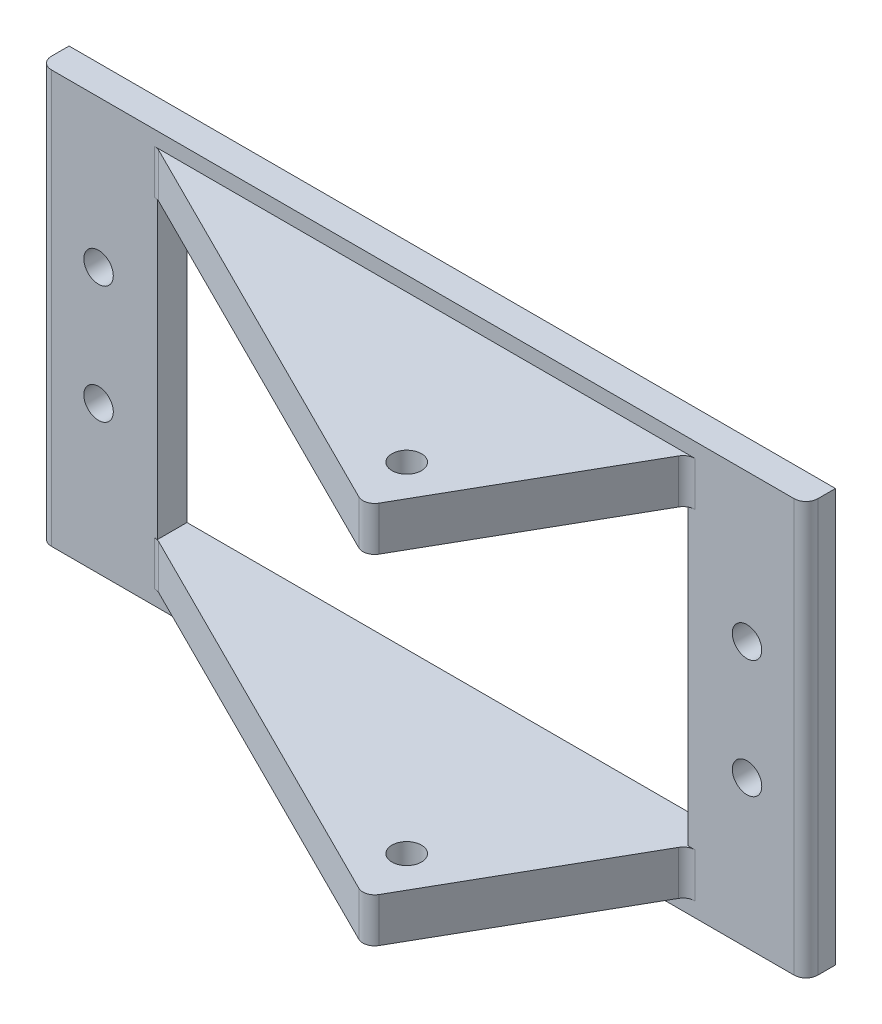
ISO-10303-21;
HEADER;
FILE_DESCRIPTION(('STEP AP214'),'2;1');
FILE_NAME('part.step','',(''),(''),'','','');
FILE_SCHEMA(('AUTOMOTIVE_DESIGN { 1 0 10303 214 1 1 1 1 }'));
ENDSEC;
DATA;
#1=APPLICATION_CONTEXT('core data for automotive mechanical design processes');
#2=APPLICATION_PROTOCOL_DEFINITION('international standard','automotive_design',2000,#1);
#3=PRODUCT_CONTEXT('',#1,'mechanical');
#4=PRODUCT('Part','Part','',(#3));
#5=PRODUCT_RELATED_PRODUCT_CATEGORY('part','',(#4));
#6=PRODUCT_DEFINITION_FORMATION('','',#4);
#7=PRODUCT_DEFINITION_CONTEXT('part definition',#1,'design');
#8=PRODUCT_DEFINITION('design','',#6,#7);
#9=PRODUCT_DEFINITION_SHAPE('','',#8);
#10=(LENGTH_UNIT() NAMED_UNIT(*) SI_UNIT(.MILLI.,.METRE.));
#11=(NAMED_UNIT(*) PLANE_ANGLE_UNIT() SI_UNIT($,.RADIAN.));
#12=(NAMED_UNIT(*) SI_UNIT($,.STERADIAN.) SOLID_ANGLE_UNIT());
#13=UNCERTAINTY_MEASURE_WITH_UNIT(LENGTH_MEASURE(1.E-05),#10,'distance_accuracy_value','');
#14=(GEOMETRIC_REPRESENTATION_CONTEXT(3) GLOBAL_UNCERTAINTY_ASSIGNED_CONTEXT((#13)) GLOBAL_UNIT_ASSIGNED_CONTEXT((#10,
#11,#12)) REPRESENTATION_CONTEXT('',''));
#15=CARTESIAN_POINT('',(0.,0.,0.));
#16=DIRECTION('',(0.,0.,1.));
#17=DIRECTION('',(1.,0.,0.));
#18=AXIS2_PLACEMENT_3D('',#15,#16,#17);
#19=CARTESIAN_POINT('',(-57.15,-31.75,0.));
#20=DIRECTION('',(0.,-1.,0.));
#21=DIRECTION('',(0.,0.,-1.));
#22=AXIS2_PLACEMENT_3D('',#19,#20,#21);
#23=PLANE('',#22);
#24=CARTESIAN_POINT('',(28.2863636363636,-31.75,38.1));
#25=DIRECTION('',(0.,-1.,0.));
#26=DIRECTION('',(0.,0.,-1.));
#27=AXIS2_PLACEMENT_3D('',#24,#25,#26);
#28=CIRCLE('',#27,3.175);
#29=CARTESIAN_POINT('',(28.2863636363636,-31.75,34.925));
#30=VERTEX_POINT('',#29);
#31=EDGE_CURVE('E372',#30,#30,#28,.T.);
#32=ORIENTED_EDGE('',*,*,#31,.T.);
#33=EDGE_LOOP('',(#32));
#34=FACE_BOUND('',#33,.T.);
#35=DIRECTION('',(-0.894427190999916,0.,-0.447213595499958));
#36=VECTOR('',#35,1.);
#37=CARTESIAN_POINT('',(-59.69,-31.75,5.08000000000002));
#38=LINE('',#37,#36);
#39=CARTESIAN_POINT('',(29.6008653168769,-31.75,49.7254326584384));
#40=VERTEX_POINT('',#39);
#41=CARTESIAN_POINT('',(-56.6136901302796,-31.75,6.61815493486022));
#42=VERTEX_POINT('',#41);
#43=EDGE_CURVE('E369',#40,#42,#38,.T.);
#44=ORIENTED_EDGE('',*,*,#43,.F.);
#45=CARTESIAN_POINT('',(30.7367878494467,-31.75,47.4535875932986));
#46=DIRECTION('',(0.,-1.,0.));
#47=DIRECTION('',(0.,0.,-1.));
#48=AXIS2_PLACEMENT_3D('',#45,#46,#47);
#49=CIRCLE('',#48,2.54);
#50=CARTESIAN_POINT('',(32.9421254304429,-31.75,48.713780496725));
#51=VERTEX_POINT('',#50);
#52=EDGE_CURVE('E322',#40,#51,#49,.F.);
#53=ORIENTED_EDGE('',*,*,#52,.T.);
#54=DIRECTION('',(-0.496138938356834,0.,0.868243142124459));
#55=VECTOR('',#54,1.);
#56=CARTESIAN_POINT('',(31.75,-31.75,50.8));
#57=LINE('',#56,#55);
#58=CARTESIAN_POINT('',(56.4186816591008,-31.75,7.62980709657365));
#59=VERTEX_POINT('',#58);
#60=EDGE_CURVE('E516',#59,#51,#57,.T.);
#61=ORIENTED_EDGE('',*,*,#60,.F.);
#62=CARTESIAN_POINT('',(58.6240192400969,-31.75,8.89));
#63=DIRECTION('',(0.,-1.,0.));
#64=DIRECTION('',(0.,0.,-1.));
#65=AXIS2_PLACEMENT_3D('',#62,#63,#64);
#66=CIRCLE('',#65,2.54);
#67=CARTESIAN_POINT('',(58.6240192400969,-31.75,6.35));
#68=VERTEX_POINT('',#67);
#69=EDGE_CURVE('E340',#59,#68,#66,.T.);
#70=ORIENTED_EDGE('',*,*,#69,.T.);
#71=DIRECTION('',(1.,0.,0.));
#72=VECTOR('',#71,1.);
#73=CARTESIAN_POINT('',(-57.15,-31.75,6.35));
#74=LINE('',#73,#72);
#75=CARTESIAN_POINT('',(57.15,-31.75,6.35));
#76=VERTEX_POINT('',#75);
#77=EDGE_CURVE('E87',#76,#68,#74,.T.);
#78=ORIENTED_EDGE('',*,*,#77,.F.);
#79=DIRECTION('',(0.,0.,1.));
#80=VECTOR('',#79,1.);
#81=CARTESIAN_POINT('',(57.15,-31.75,0.));
#82=LINE('',#81,#80);
#83=CARTESIAN_POINT('',(57.15,-31.75,0.));
#84=VERTEX_POINT('',#83);
#85=EDGE_CURVE('E228',#84,#76,#82,.T.);
#86=ORIENTED_EDGE('',*,*,#85,.F.);
#87=DIRECTION('',(1.,0.,0.));
#88=VECTOR('',#87,1.);
#89=CARTESIAN_POINT('',(-57.15,-31.75,0.));
#90=LINE('',#89,#88);
#91=CARTESIAN_POINT('',(-57.15,-31.75,0.));
#92=VERTEX_POINT('',#91);
#93=EDGE_CURVE('E238',#92,#84,#90,.T.);
#94=ORIENTED_EDGE('',*,*,#93,.F.);
#95=DIRECTION('',(0.,0.,1.));
#96=VECTOR('',#95,1.);
#97=CARTESIAN_POINT('',(-57.15,-31.75,0.));
#98=LINE('',#97,#96);
#99=CARTESIAN_POINT('',(-57.15,-31.75,6.35));
#100=VERTEX_POINT('',#99);
#101=EDGE_CURVE('E241',#92,#100,#98,.T.);
#102=ORIENTED_EDGE('',*,*,#101,.T.);
#103=DIRECTION('',(1.,0.,0.));
#104=VECTOR('',#103,1.);
#105=CARTESIAN_POINT('',(-57.15,-31.75,6.35));
#106=LINE('',#105,#104);
#107=CARTESIAN_POINT('',(-57.7496126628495,-31.75,6.35));
#108=VERTEX_POINT('',#107);
#109=EDGE_CURVE('E280',#108,#100,#106,.T.);
#110=ORIENTED_EDGE('',*,*,#109,.F.);
#111=CARTESIAN_POINT('',(-57.7496126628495,-31.75,8.89));
#112=DIRECTION('',(0.,-1.,0.));
#113=DIRECTION('',(0.,0.,-1.));
#114=AXIS2_PLACEMENT_3D('',#111,#112,#113);
#115=CIRCLE('',#114,2.54);
#116=EDGE_CURVE('E347',#108,#42,#115,.T.);
#117=ORIENTED_EDGE('',*,*,#116,.T.);
#118=EDGE_LOOP('',(#44,#53,#61,#70,#78,#86,#94,#102,#110,#117));
#119=FACE_BOUND('',#118,.T.);
#120=ADVANCED_FACE('F64',(#34,#119),#23,.F.);
#121=CARTESIAN_POINT('',(-57.15,31.75,0.));
#122=DIRECTION('',(0.,1.,0.));
#123=DIRECTION('',(0.,0.,1.));
#124=AXIS2_PLACEMENT_3D('',#121,#122,#123);
#125=PLANE('',#124);
#126=CARTESIAN_POINT('',(28.2863636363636,31.75,38.1));
#127=DIRECTION('',(0.,1.,0.));
#128=DIRECTION('',(0.,0.,1.));
#129=AXIS2_PLACEMENT_3D('',#126,#127,#128);
#130=CIRCLE('',#129,3.175);
#131=CARTESIAN_POINT('',(28.2863636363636,31.75,41.275));
#132=VERTEX_POINT('',#131);
#133=EDGE_CURVE('E526',#132,#132,#130,.T.);
#134=ORIENTED_EDGE('',*,*,#133,.T.);
#135=EDGE_LOOP('',(#134));
#136=FACE_BOUND('',#135,.T.);
#137=DIRECTION('',(0.496138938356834,0.,-0.868243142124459));
#138=VECTOR('',#137,1.);
#139=CARTESIAN_POINT('',(31.75,31.75,50.8));
#140=LINE('',#139,#138);
#141=CARTESIAN_POINT('',(32.9421254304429,31.75,48.713780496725));
#142=VERTEX_POINT('',#141);
#143=CARTESIAN_POINT('',(56.4186816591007,31.75,7.62980709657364));
#144=VERTEX_POINT('',#143);
#145=EDGE_CURVE('E523',#142,#144,#140,.T.);
#146=ORIENTED_EDGE('',*,*,#145,.F.);
#147=CARTESIAN_POINT('',(30.7367878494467,31.75,47.4535875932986));
#148=DIRECTION('',(0.,1.,0.));
#149=DIRECTION('',(0.,0.,1.));
#150=AXIS2_PLACEMENT_3D('',#147,#148,#149);
#151=CIRCLE('',#150,2.54);
#152=CARTESIAN_POINT('',(29.6008653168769,31.75,49.7254326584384));
#153=VERTEX_POINT('',#152);
#154=EDGE_CURVE('E324',#142,#153,#151,.F.);
#155=ORIENTED_EDGE('',*,*,#154,.T.);
#156=DIRECTION('',(0.894427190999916,0.,0.447213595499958));
#157=VECTOR('',#156,1.);
#158=CARTESIAN_POINT('',(-59.69,31.75,5.08000000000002));
#159=LINE('',#158,#157);
#160=CARTESIAN_POINT('',(-56.6136901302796,31.75,6.61815493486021));
#161=VERTEX_POINT('',#160);
#162=EDGE_CURVE('E350',#161,#153,#159,.T.);
#163=ORIENTED_EDGE('',*,*,#162,.F.);
#164=CARTESIAN_POINT('',(-57.7496126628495,31.75,8.89));
#165=DIRECTION('',(0.,1.,0.));
#166=DIRECTION('',(0.,0.,1.));
#167=AXIS2_PLACEMENT_3D('',#164,#165,#166);
#168=CIRCLE('',#167,2.54);
#169=CARTESIAN_POINT('',(-57.7496126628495,31.75,6.35));
#170=VERTEX_POINT('',#169);
#171=EDGE_CURVE('E72',#161,#170,#168,.T.);
#172=ORIENTED_EDGE('',*,*,#171,.T.);
#173=DIRECTION('',(-1.,0.,0.));
#174=VECTOR('',#173,1.);
#175=CARTESIAN_POINT('',(-57.15,31.75,6.35));
#176=LINE('',#175,#174);
#177=CARTESIAN_POINT('',(-57.15,31.75,6.35));
#178=VERTEX_POINT('',#177);
#179=EDGE_CURVE('E79',#178,#170,#176,.T.);
#180=ORIENTED_EDGE('',*,*,#179,.F.);
#181=DIRECTION('',(0.,0.,1.));
#182=VECTOR('',#181,1.);
#183=CARTESIAN_POINT('',(-57.15,31.75,0.));
#184=LINE('',#183,#182);
#185=CARTESIAN_POINT('',(-57.15,31.75,0.));
#186=VERTEX_POINT('',#185);
#187=EDGE_CURVE('E237',#186,#178,#184,.T.);
#188=ORIENTED_EDGE('',*,*,#187,.F.);
#189=DIRECTION('',(-1.,0.,0.));
#190=VECTOR('',#189,1.);
#191=CARTESIAN_POINT('',(-57.15,31.75,0.));
#192=LINE('',#191,#190);
#193=CARTESIAN_POINT('',(57.15,31.75,0.));
#194=VERTEX_POINT('',#193);
#195=EDGE_CURVE('E235',#194,#186,#192,.T.);
#196=ORIENTED_EDGE('',*,*,#195,.F.);
#197=DIRECTION('',(0.,0.,1.));
#198=VECTOR('',#197,1.);
#199=CARTESIAN_POINT('',(57.15,31.75,0.));
#200=LINE('',#199,#198);
#201=CARTESIAN_POINT('',(57.15,31.75,6.35));
#202=VERTEX_POINT('',#201);
#203=EDGE_CURVE('E226',#194,#202,#200,.T.);
#204=ORIENTED_EDGE('',*,*,#203,.T.);
#205=DIRECTION('',(-1.,0.,0.));
#206=VECTOR('',#205,1.);
#207=CARTESIAN_POINT('',(-57.15,31.75,6.35));
#208=LINE('',#207,#206);
#209=CARTESIAN_POINT('',(58.6240192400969,31.75,6.35));
#210=VERTEX_POINT('',#209);
#211=EDGE_CURVE('E212',#210,#202,#208,.T.);
#212=ORIENTED_EDGE('',*,*,#211,.F.);
#213=CARTESIAN_POINT('',(58.6240192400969,31.75,8.89));
#214=DIRECTION('',(0.,1.,0.));
#215=DIRECTION('',(0.,0.,1.));
#216=AXIS2_PLACEMENT_3D('',#213,#214,#215);
#217=CIRCLE('',#216,2.54);
#218=EDGE_CURVE('E338',#210,#144,#217,.T.);
#219=ORIENTED_EDGE('',*,*,#218,.T.);
#220=EDGE_LOOP('',(#146,#155,#163,#172,#180,#188,#196,#204,#212,#219));
#221=FACE_BOUND('',#220,.T.);
#222=ADVANCED_FACE('F233',(#136,#221),#125,.F.);
#223=CARTESIAN_POINT('',(57.15,41.275,6.35));
#224=DIRECTION('',(0.,1.,0.));
#225=DIRECTION('',(-1.,0.,0.));
#226=AXIS2_PLACEMENT_3D('',#223,#224,#225);
#227=PLANE('',#226);
#228=CARTESIAN_POINT('',(28.2863636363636,41.275,38.1));
#229=DIRECTION('',(0.,1.,0.));
#230=DIRECTION('',(-1.,0.,0.));
#231=AXIS2_PLACEMENT_3D('',#228,#229,#230);
#232=CIRCLE('',#231,3.175);
#233=CARTESIAN_POINT('',(25.1113636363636,41.275,38.1));
#234=VERTEX_POINT('',#233);
#235=EDGE_CURVE('E522',#234,#234,#232,.T.);
#236=ORIENTED_EDGE('',*,*,#235,.F.);
#237=EDGE_LOOP('',(#236));
#238=FACE_BOUND('',#237,.T.);
#239=DIRECTION('',(0.894427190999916,0.,0.447213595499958));
#240=VECTOR('',#239,1.);
#241=CARTESIAN_POINT('',(34.29,41.275,52.07));
#242=LINE('',#241,#240);
#243=CARTESIAN_POINT('',(-56.6136901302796,41.275,6.6181549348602));
#244=VERTEX_POINT('',#243);
#245=CARTESIAN_POINT('',(29.6008653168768,41.275,49.7254326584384));
#246=VERTEX_POINT('',#245);
#247=EDGE_CURVE('E362',#244,#246,#242,.T.);
#248=ORIENTED_EDGE('',*,*,#247,.T.);
#249=CARTESIAN_POINT('',(30.7367878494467,41.275,47.4535875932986));
#250=DIRECTION('',(0.,1.,0.));
#251=DIRECTION('',(-1.,0.,0.));
#252=AXIS2_PLACEMENT_3D('',#249,#250,#251);
#253=CIRCLE('',#252,2.54);
#254=CARTESIAN_POINT('',(32.9421254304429,41.275,48.713780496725));
#255=VERTEX_POINT('',#254);
#256=EDGE_CURVE('E331',#246,#255,#253,.T.);
#257=ORIENTED_EDGE('',*,*,#256,.T.);
#258=DIRECTION('',(0.496138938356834,0.,-0.868243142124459));
#259=VECTOR('',#258,1.);
#260=CARTESIAN_POINT('',(57.15,41.275,6.35));
#261=LINE('',#260,#259);
#262=CARTESIAN_POINT('',(56.4186816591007,41.275,7.62980709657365));
#263=VERTEX_POINT('',#262);
#264=EDGE_CURVE('E529',#255,#263,#261,.T.);
#265=ORIENTED_EDGE('',*,*,#264,.T.);
#266=CARTESIAN_POINT('',(58.6240192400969,41.275,8.89));
#267=DIRECTION('',(0.,1.,0.));
#268=DIRECTION('',(-1.,0.,0.));
#269=AXIS2_PLACEMENT_3D('',#266,#267,#268);
#270=CIRCLE('',#269,2.54);
#271=CARTESIAN_POINT('',(58.6240192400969,41.275,6.35));
#272=VERTEX_POINT('',#271);
#273=EDGE_CURVE('E335',#263,#272,#270,.F.);
#274=ORIENTED_EDGE('',*,*,#273,.T.);
#275=DIRECTION('',(-1.,0.,0.));
#276=VECTOR('',#275,1.);
#277=CARTESIAN_POINT('',(57.15,41.275,6.35));
#278=LINE('',#277,#276);
#279=CARTESIAN_POINT('',(-57.7496126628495,41.275,6.35));
#280=VERTEX_POINT('',#279);
#281=EDGE_CURVE('E229',#272,#280,#278,.T.);
#282=ORIENTED_EDGE('',*,*,#281,.T.);
#283=CARTESIAN_POINT('',(-57.7496126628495,41.275,8.89));
#284=DIRECTION('',(0.,1.,0.));
#285=DIRECTION('',(-1.,0.,0.));
#286=AXIS2_PLACEMENT_3D('',#283,#284,#285);
#287=CIRCLE('',#286,2.54);
#288=EDGE_CURVE('E12',#280,#244,#287,.F.);
#289=ORIENTED_EDGE('',*,*,#288,.T.);
#290=EDGE_LOOP('',(#248,#257,#265,#274,#282,#289));
#291=FACE_BOUND('',#290,.T.);
#292=ADVANCED_FACE('F361',(#238,#291),#227,.T.);
#293=CARTESIAN_POINT('',(57.15,-41.275,6.35));
#294=DIRECTION('',(0.,-1.,0.));
#295=DIRECTION('',(1.,0.,0.));
#296=AXIS2_PLACEMENT_3D('',#293,#294,#295);
#297=PLANE('',#296);
#298=CARTESIAN_POINT('',(28.2863636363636,-41.275,38.1));
#299=DIRECTION('',(0.,-1.,0.));
#300=DIRECTION('',(1.,0.,0.));
#301=AXIS2_PLACEMENT_3D('',#298,#299,#300);
#302=CIRCLE('',#301,3.175);
#303=CARTESIAN_POINT('',(31.4613636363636,-41.275,38.1));
#304=VERTEX_POINT('',#303);
#305=EDGE_CURVE('E767',#304,#304,#302,.T.);
#306=ORIENTED_EDGE('',*,*,#305,.F.);
#307=EDGE_LOOP('',(#306));
#308=FACE_BOUND('',#307,.T.);
#309=DIRECTION('',(-0.496138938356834,0.,0.868243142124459));
#310=VECTOR('',#309,1.);
#311=CARTESIAN_POINT('',(45.8176923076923,-41.275,26.1815384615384));
#312=LINE('',#311,#310);
#313=CARTESIAN_POINT('',(56.4186816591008,-41.275,7.62980709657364));
#314=VERTEX_POINT('',#313);
#315=CARTESIAN_POINT('',(32.9421254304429,-41.275,48.713780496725));
#316=VERTEX_POINT('',#315);
#317=EDGE_CURVE('E766',#314,#316,#312,.T.);
#318=ORIENTED_EDGE('',*,*,#317,.T.);
#319=CARTESIAN_POINT('',(30.7367878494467,-41.275,47.4535875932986));
#320=DIRECTION('',(0.,-1.,0.));
#321=DIRECTION('',(1.,0.,0.));
#322=AXIS2_PLACEMENT_3D('',#319,#320,#321);
#323=CIRCLE('',#322,2.54);
#324=CARTESIAN_POINT('',(29.6008653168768,-41.275,49.7254326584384));
#325=VERTEX_POINT('',#324);
#326=EDGE_CURVE('E315',#316,#325,#323,.T.);
#327=ORIENTED_EDGE('',*,*,#326,.T.);
#328=DIRECTION('',(-0.894427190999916,0.,-0.447213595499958));
#329=VECTOR('',#328,1.);
#330=CARTESIAN_POINT('',(-13.97,-41.275,27.94));
#331=LINE('',#330,#329);
#332=CARTESIAN_POINT('',(-56.6136901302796,-41.275,6.61815493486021));
#333=VERTEX_POINT('',#332);
#334=EDGE_CURVE('E367',#325,#333,#331,.T.);
#335=ORIENTED_EDGE('',*,*,#334,.T.);
#336=CARTESIAN_POINT('',(-57.7496126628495,-41.275,8.89));
#337=DIRECTION('',(0.,-1.,0.));
#338=DIRECTION('',(1.,0.,0.));
#339=AXIS2_PLACEMENT_3D('',#336,#337,#338);
#340=CIRCLE('',#339,2.54);
#341=CARTESIAN_POINT('',(-57.7496126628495,-41.275,6.35));
#342=VERTEX_POINT('',#341);
#343=EDGE_CURVE('E344',#333,#342,#340,.F.);
#344=ORIENTED_EDGE('',*,*,#343,.T.);
#345=DIRECTION('',(1.,0.,0.));
#346=VECTOR('',#345,1.);
#347=CARTESIAN_POINT('',(57.15,-41.275,6.35));
#348=LINE('',#347,#346);
#349=CARTESIAN_POINT('',(58.6240192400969,-41.275,6.35));
#350=VERTEX_POINT('',#349);
#351=EDGE_CURVE('E230',#342,#350,#348,.T.);
#352=ORIENTED_EDGE('',*,*,#351,.T.);
#353=CARTESIAN_POINT('',(58.6240192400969,-41.275,8.89));
#354=DIRECTION('',(0.,-1.,0.));
#355=DIRECTION('',(1.,0.,0.));
#356=AXIS2_PLACEMENT_3D('',#353,#354,#355);
#357=CIRCLE('',#356,2.54);
#358=EDGE_CURVE('E342',#350,#314,#357,.F.);
#359=ORIENTED_EDGE('',*,*,#358,.T.);
#360=EDGE_LOOP('',(#318,#327,#335,#344,#352,#359));
#361=FACE_BOUND('',#360,.T.);
#362=ADVANCED_FACE('F481',(#308,#361),#297,.T.);
#363=CARTESIAN_POINT('',(82.5499999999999,44.45,50.8));
#364=DIRECTION('',(-1.,0.,0.));
#365=DIRECTION('',(0.,-1.,0.));
#366=AXIS2_PLACEMENT_3D('',#363,#364,#365);
#367=PLANE('',#366);
#368=DIRECTION('',(0.,0.,-1.));
#369=VECTOR('',#368,1.);
#370=CARTESIAN_POINT('',(82.5499999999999,44.45,50.8));
#371=LINE('',#370,#369);
#372=CARTESIAN_POINT('',(82.5499999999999,44.45,3.81));
#373=VERTEX_POINT('',#372);
#374=CARTESIAN_POINT('',(82.5499999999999,44.45,0.));
#375=VERTEX_POINT('',#374);
#376=EDGE_CURVE('E266',#373,#375,#371,.T.);
#377=ORIENTED_EDGE('',*,*,#376,.F.);
#378=DIRECTION('',(0.,1.,0.));
#379=VECTOR('',#378,1.);
#380=CARTESIAN_POINT('',(82.5499999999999,44.45,3.81));
#381=LINE('',#380,#379);
#382=CARTESIAN_POINT('',(82.55,-44.45,3.81));
#383=VERTEX_POINT('',#382);
#384=EDGE_CURVE('E297',#373,#383,#381,.F.);
#385=ORIENTED_EDGE('',*,*,#384,.T.);
#386=DIRECTION('',(0.,0.,-1.));
#387=VECTOR('',#386,1.);
#388=CARTESIAN_POINT('',(82.55,-44.45,50.8));
#389=LINE('',#388,#387);
#390=CARTESIAN_POINT('',(82.55,-44.45,0.));
#391=VERTEX_POINT('',#390);
#392=EDGE_CURVE('E260',#383,#391,#389,.T.);
#393=ORIENTED_EDGE('',*,*,#392,.T.);
#394=DIRECTION('',(0.,1.,0.));
#395=VECTOR('',#394,1.);
#396=CARTESIAN_POINT('',(82.5499999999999,44.45,0.));
#397=LINE('',#396,#395);
#398=EDGE_CURVE('E248',#391,#375,#397,.T.);
#399=ORIENTED_EDGE('',*,*,#398,.T.);
#400=EDGE_LOOP('',(#377,#385,#393,#399));
#401=FACE_BOUND('',#400,.T.);
#402=ADVANCED_FACE('F429',(#401),#367,.F.);
#403=CARTESIAN_POINT('',(-82.5500000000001,44.45,50.8));
#404=DIRECTION('',(0.,-1.,0.));
#405=DIRECTION('',(0.,0.,-1.));
#406=AXIS2_PLACEMENT_3D('',#403,#404,#405);
#407=PLANE('',#406);
#408=DIRECTION('',(-1.,0.,0.));
#409=VECTOR('',#408,1.);
#410=CARTESIAN_POINT('',(82.55,44.45,6.35));
#411=LINE('',#410,#409);
#412=CARTESIAN_POINT('',(80.0099999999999,44.45,6.35));
#413=VERTEX_POINT('',#412);
#414=CARTESIAN_POINT('',(-80.01,44.45,6.35));
#415=VERTEX_POINT('',#414);
#416=EDGE_CURVE('E273',#413,#415,#411,.T.);
#417=ORIENTED_EDGE('',*,*,#416,.F.);
#418=CARTESIAN_POINT('',(80.0099999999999,44.45,3.81));
#419=DIRECTION('',(0.,-1.,0.));
#420=DIRECTION('',(0.,0.,-1.));
#421=AXIS2_PLACEMENT_3D('',#418,#419,#420);
#422=CIRCLE('',#421,2.54);
#423=EDGE_CURVE('E295',#413,#373,#422,.F.);
#424=ORIENTED_EDGE('',*,*,#423,.T.);
#425=ORIENTED_EDGE('',*,*,#376,.T.);
#426=DIRECTION('',(-1.,0.,0.));
#427=VECTOR('',#426,1.);
#428=CARTESIAN_POINT('',(-82.5500000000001,44.45,0.));
#429=LINE('',#428,#427);
#430=CARTESIAN_POINT('',(-82.5500000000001,44.45,0.));
#431=VERTEX_POINT('',#430);
#432=EDGE_CURVE('E251',#375,#431,#429,.T.);
#433=ORIENTED_EDGE('',*,*,#432,.T.);
#434=DIRECTION('',(0.,0.,-1.));
#435=VECTOR('',#434,1.);
#436=CARTESIAN_POINT('',(-82.5500000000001,44.45,50.8));
#437=LINE('',#436,#435);
#438=CARTESIAN_POINT('',(-82.5500000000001,44.45,3.81));
#439=VERTEX_POINT('',#438);
#440=EDGE_CURVE('E264',#439,#431,#437,.T.);
#441=ORIENTED_EDGE('',*,*,#440,.F.);
#442=CARTESIAN_POINT('',(-80.0100000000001,44.45,3.81));
#443=DIRECTION('',(0.,-1.,0.));
#444=DIRECTION('',(0.,0.,-1.));
#445=AXIS2_PLACEMENT_3D('',#442,#443,#444);
#446=CIRCLE('',#445,2.54);
#447=EDGE_CURVE('E293',#439,#415,#446,.F.);
#448=ORIENTED_EDGE('',*,*,#447,.T.);
#449=EDGE_LOOP('',(#417,#424,#425,#433,#441,#448));
#450=FACE_BOUND('',#449,.T.);
#451=ADVANCED_FACE('F443',(#450),#407,.F.);
#452=CARTESIAN_POINT('',(-82.5500000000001,44.45,50.8));
#453=DIRECTION('',(1.,0.,0.));
#454=DIRECTION('',(0.,1.,0.));
#455=AXIS2_PLACEMENT_3D('',#452,#453,#454);
#456=PLANE('',#455);
#457=DIRECTION('',(0.,0.,-1.));
#458=VECTOR('',#457,1.);
#459=CARTESIAN_POINT('',(-82.55,-44.45,50.8));
#460=LINE('',#459,#458);
#461=CARTESIAN_POINT('',(-82.55,-44.45,3.81));
#462=VERTEX_POINT('',#461);
#463=CARTESIAN_POINT('',(-82.55,-44.45,0.));
#464=VERTEX_POINT('',#463);
#465=EDGE_CURVE('E262',#462,#464,#460,.T.);
#466=ORIENTED_EDGE('',*,*,#465,.F.);
#467=DIRECTION('',(0.,-1.,0.));
#468=VECTOR('',#467,1.);
#469=CARTESIAN_POINT('',(-82.5500000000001,44.45,3.81));
#470=LINE('',#469,#468);
#471=EDGE_CURVE('E333',#462,#439,#470,.F.);
#472=ORIENTED_EDGE('',*,*,#471,.T.);
#473=ORIENTED_EDGE('',*,*,#440,.T.);
#474=DIRECTION('',(0.,-1.,0.));
#475=VECTOR('',#474,1.);
#476=CARTESIAN_POINT('',(-82.5500000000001,44.45,0.));
#477=LINE('',#476,#475);
#478=EDGE_CURVE('E254',#431,#464,#477,.T.);
#479=ORIENTED_EDGE('',*,*,#478,.T.);
#480=EDGE_LOOP('',(#466,#472,#473,#479));
#481=FACE_BOUND('',#480,.T.);
#482=ADVANCED_FACE('F438',(#481),#456,.F.);
#483=CARTESIAN_POINT('',(-82.55,-44.45,50.8));
#484=DIRECTION('',(0.,1.,0.));
#485=DIRECTION('',(0.,0.,1.));
#486=AXIS2_PLACEMENT_3D('',#483,#484,#485);
#487=PLANE('',#486);
#488=ORIENTED_EDGE('',*,*,#392,.F.);
#489=CARTESIAN_POINT('',(80.01,-44.45,3.81));
#490=DIRECTION('',(0.,1.,0.));
#491=DIRECTION('',(0.,0.,1.));
#492=AXIS2_PLACEMENT_3D('',#489,#490,#491);
#493=CIRCLE('',#492,2.54);
#494=CARTESIAN_POINT('',(80.01,-44.45,6.35));
#495=VERTEX_POINT('',#494);
#496=EDGE_CURVE('E301',#383,#495,#493,.F.);
#497=ORIENTED_EDGE('',*,*,#496,.T.);
#498=DIRECTION('',(1.,0.,0.));
#499=VECTOR('',#498,1.);
#500=CARTESIAN_POINT('',(82.55,-44.45,6.35));
#501=LINE('',#500,#499);
#502=CARTESIAN_POINT('',(-80.01,-44.45,6.35));
#503=VERTEX_POINT('',#502);
#504=EDGE_CURVE('E381',#503,#495,#501,.T.);
#505=ORIENTED_EDGE('',*,*,#504,.F.);
#506=CARTESIAN_POINT('',(-80.01,-44.45,3.81));
#507=DIRECTION('',(0.,1.,0.));
#508=DIRECTION('',(0.,0.,1.));
#509=AXIS2_PLACEMENT_3D('',#506,#507,#508);
#510=CIRCLE('',#509,2.54);
#511=EDGE_CURVE('E299',#503,#462,#510,.F.);
#512=ORIENTED_EDGE('',*,*,#511,.T.);
#513=ORIENTED_EDGE('',*,*,#465,.T.);
#514=DIRECTION('',(1.,0.,0.));
#515=VECTOR('',#514,1.);
#516=CARTESIAN_POINT('',(-82.55,-44.45,0.));
#517=LINE('',#516,#515);
#518=EDGE_CURVE('E257',#464,#391,#517,.T.);
#519=ORIENTED_EDGE('',*,*,#518,.T.);
#520=EDGE_LOOP('',(#488,#497,#505,#512,#513,#519));
#521=FACE_BOUND('',#520,.T.);
#522=ADVANCED_FACE('F420',(#521),#487,.F.);
#523=CARTESIAN_POINT('',(0.,0.,0.));
#524=DIRECTION('',(0.,0.,1.));
#525=DIRECTION('',(1.,0.,0.));
#526=AXIS2_PLACEMENT_3D('',#523,#524,#525);
#527=PLANE('',#526);
#528=CARTESIAN_POINT('',(69.85,12.7,0.));
#529=DIRECTION('',(0.,0.,1.));
#530=DIRECTION('',(-1.,0.,0.));
#531=AXIS2_PLACEMENT_3D('',#528,#529,#530);
#532=CIRCLE('',#531,3.175);
#533=CARTESIAN_POINT('',(66.675,12.7,0.));
#534=VERTEX_POINT('',#533);
#535=EDGE_CURVE('E394',#534,#534,#532,.T.);
#536=ORIENTED_EDGE('',*,*,#535,.T.);
#537=EDGE_LOOP('',(#536));
#538=FACE_BOUND('',#537,.T.);
#539=CARTESIAN_POINT('',(69.85,-12.7,0.));
#540=DIRECTION('',(0.,0.,1.));
#541=DIRECTION('',(1.,0.,0.));
#542=AXIS2_PLACEMENT_3D('',#539,#540,#541);
#543=CIRCLE('',#542,3.17499999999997);
#544=CARTESIAN_POINT('',(73.025,-12.7,0.));
#545=VERTEX_POINT('',#544);
#546=EDGE_CURVE('E402',#545,#545,#543,.T.);
#547=ORIENTED_EDGE('',*,*,#546,.T.);
#548=EDGE_LOOP('',(#547));
#549=FACE_BOUND('',#548,.T.);
#550=CARTESIAN_POINT('',(-69.85,-12.7,0.));
#551=DIRECTION('',(0.,0.,1.));
#552=DIRECTION('',(-1.,0.,0.));
#553=AXIS2_PLACEMENT_3D('',#550,#551,#552);
#554=CIRCLE('',#553,3.175);
#555=CARTESIAN_POINT('',(-73.025,-12.7,0.));
#556=VERTEX_POINT('',#555);
#557=EDGE_CURVE('E399',#556,#556,#554,.T.);
#558=ORIENTED_EDGE('',*,*,#557,.T.);
#559=EDGE_LOOP('',(#558));
#560=FACE_BOUND('',#559,.T.);
#561=CARTESIAN_POINT('',(-69.85,12.7,0.));
#562=DIRECTION('',(0.,0.,1.));
#563=DIRECTION('',(1.,0.,0.));
#564=AXIS2_PLACEMENT_3D('',#561,#562,#563);
#565=CIRCLE('',#564,3.175);
#566=CARTESIAN_POINT('',(-66.675,12.7,0.));
#567=VERTEX_POINT('',#566);
#568=EDGE_CURVE('E395',#567,#567,#565,.T.);
#569=ORIENTED_EDGE('',*,*,#568,.T.);
#570=EDGE_LOOP('',(#569));
#571=FACE_BOUND('',#570,.T.);
#572=ORIENTED_EDGE('',*,*,#93,.T.);
#573=DIRECTION('',(0.,1.,0.));
#574=VECTOR('',#573,1.);
#575=CARTESIAN_POINT('',(57.15,31.75,0.));
#576=LINE('',#575,#574);
#577=EDGE_CURVE('E398',#84,#194,#576,.T.);
#578=ORIENTED_EDGE('',*,*,#577,.T.);
#579=ORIENTED_EDGE('',*,*,#195,.T.);
#580=DIRECTION('',(0.,-1.,0.));
#581=VECTOR('',#580,1.);
#582=CARTESIAN_POINT('',(-57.15,31.75,0.));
#583=LINE('',#582,#581);
#584=EDGE_CURVE('E244',#186,#92,#583,.T.);
#585=ORIENTED_EDGE('',*,*,#584,.T.);
#586=EDGE_LOOP('',(#572,#578,#579,#585));
#587=FACE_BOUND('',#586,.T.);
#588=ORIENTED_EDGE('',*,*,#398,.F.);
#589=ORIENTED_EDGE('',*,*,#518,.F.);
#590=ORIENTED_EDGE('',*,*,#478,.F.);
#591=ORIENTED_EDGE('',*,*,#432,.F.);
#592=EDGE_LOOP('',(#588,#589,#590,#591));
#593=FACE_BOUND('',#592,.T.);
#594=ADVANCED_FACE('F417',(#538,#549,#560,#571,#587,#593),#527,.F.);
#595=CARTESIAN_POINT('',(57.15,31.75,0.));
#596=DIRECTION('',(1.,0.,0.));
#597=DIRECTION('',(0.,1.,0.));
#598=AXIS2_PLACEMENT_3D('',#595,#596,#597);
#599=PLANE('',#598);
#600=ORIENTED_EDGE('',*,*,#85,.T.);
#601=DIRECTION('',(0.,1.,0.));
#602=VECTOR('',#601,1.);
#603=CARTESIAN_POINT('',(57.15,41.275,6.35));
#604=LINE('',#603,#602);
#605=EDGE_CURVE('E216',#76,#202,#604,.T.);
#606=ORIENTED_EDGE('',*,*,#605,.T.);
#607=ORIENTED_EDGE('',*,*,#203,.F.);
#608=ORIENTED_EDGE('',*,*,#577,.F.);
#609=EDGE_LOOP('',(#600,#606,#607,#608));
#610=FACE_BOUND('',#609,.T.);
#611=ADVANCED_FACE('F224',(#610),#599,.F.);
#612=CARTESIAN_POINT('',(-57.15,31.75,0.));
#613=DIRECTION('',(-1.,0.,0.));
#614=DIRECTION('',(0.,0.,1.));
#615=AXIS2_PLACEMENT_3D('',#612,#613,#614);
#616=PLANE('',#615);
#617=ORIENTED_EDGE('',*,*,#187,.T.);
#618=DIRECTION('',(0.,-1.,0.));
#619=VECTOR('',#618,1.);
#620=CARTESIAN_POINT('',(-57.15,41.275,6.35));
#621=LINE('',#620,#619);
#622=EDGE_CURVE('E356',#178,#100,#621,.T.);
#623=ORIENTED_EDGE('',*,*,#622,.T.);
#624=ORIENTED_EDGE('',*,*,#101,.F.);
#625=ORIENTED_EDGE('',*,*,#584,.F.);
#626=EDGE_LOOP('',(#617,#623,#624,#625));
#627=FACE_BOUND('',#626,.T.);
#628=ADVANCED_FACE('F415',(#627),#616,.F.);
#629=CARTESIAN_POINT('',(-69.85,12.7,0.));
#630=DIRECTION('',(0.,0.,1.));
#631=DIRECTION('',(1.,0.,0.));
#632=AXIS2_PLACEMENT_3D('',#629,#630,#631);
#633=CYLINDRICAL_SURFACE('',#632,3.175);
#634=CARTESIAN_POINT('',(-69.85,12.7,6.35));
#635=DIRECTION('',(0.,0.,-1.));
#636=DIRECTION('',(-1.,0.,0.));
#637=AXIS2_PLACEMENT_3D('',#634,#635,#636);
#638=CIRCLE('',#637,3.175);
#639=CARTESIAN_POINT('',(-73.025,12.7,6.35));
#640=VERTEX_POINT('',#639);
#641=EDGE_CURVE('E391',#640,#640,#638,.F.);
#642=ORIENTED_EDGE('',*,*,#641,.T.);
#643=EDGE_LOOP('',(#642));
#644=FACE_BOUND('',#643,.T.);
#645=ORIENTED_EDGE('',*,*,#568,.F.);
#646=EDGE_LOOP('',(#645));
#647=FACE_BOUND('',#646,.T.);
#648=ADVANCED_FACE('F469',(#644,#647),#633,.F.);
#649=CARTESIAN_POINT('',(-69.85,-12.7,0.));
#650=DIRECTION('',(0.,0.,1.));
#651=DIRECTION('',(1.,0.,0.));
#652=AXIS2_PLACEMENT_3D('',#649,#650,#651);
#653=CYLINDRICAL_SURFACE('',#652,3.175);
#654=CARTESIAN_POINT('',(-69.85,-12.7,6.35));
#655=DIRECTION('',(0.,0.,-1.));
#656=DIRECTION('',(-1.,0.,0.));
#657=AXIS2_PLACEMENT_3D('',#654,#655,#656);
#658=CIRCLE('',#657,3.175);
#659=CARTESIAN_POINT('',(-73.025,-12.7,6.35));
#660=VERTEX_POINT('',#659);
#661=EDGE_CURVE('E388',#660,#660,#658,.F.);
#662=ORIENTED_EDGE('',*,*,#661,.T.);
#663=EDGE_LOOP('',(#662));
#664=FACE_BOUND('',#663,.T.);
#665=ORIENTED_EDGE('',*,*,#557,.F.);
#666=EDGE_LOOP('',(#665));
#667=FACE_BOUND('',#666,.T.);
#668=ADVANCED_FACE('F561',(#664,#667),#653,.F.);
#669=CARTESIAN_POINT('',(69.85,-12.7,0.));
#670=DIRECTION('',(0.,0.,1.));
#671=DIRECTION('',(1.,0.,0.));
#672=AXIS2_PLACEMENT_3D('',#669,#670,#671);
#673=CYLINDRICAL_SURFACE('',#672,3.17499999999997);
#674=CARTESIAN_POINT('',(69.85,-12.7,6.35));
#675=DIRECTION('',(0.,0.,-1.));
#676=DIRECTION('',(-1.,0.,0.));
#677=AXIS2_PLACEMENT_3D('',#674,#675,#676);
#678=CIRCLE('',#677,3.17499999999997);
#679=CARTESIAN_POINT('',(66.6750000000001,-12.7,6.35));
#680=VERTEX_POINT('',#679);
#681=EDGE_CURVE('E272',#680,#680,#678,.F.);
#682=ORIENTED_EDGE('',*,*,#681,.T.);
#683=EDGE_LOOP('',(#682));
#684=FACE_BOUND('',#683,.T.);
#685=ORIENTED_EDGE('',*,*,#546,.F.);
#686=EDGE_LOOP('',(#685));
#687=FACE_BOUND('',#686,.T.);
#688=ADVANCED_FACE('F564',(#684,#687),#673,.F.);
#689=CARTESIAN_POINT('',(69.85,12.7,0.));
#690=DIRECTION('',(0.,0.,1.));
#691=DIRECTION('',(1.,0.,0.));
#692=AXIS2_PLACEMENT_3D('',#689,#690,#691);
#693=CYLINDRICAL_SURFACE('',#692,3.175);
#694=CARTESIAN_POINT('',(69.85,12.7,6.35));
#695=DIRECTION('',(0.,0.,-1.));
#696=DIRECTION('',(-1.,0.,0.));
#697=AXIS2_PLACEMENT_3D('',#694,#695,#696);
#698=CIRCLE('',#697,3.175);
#699=CARTESIAN_POINT('',(66.675,12.7,6.35));
#700=VERTEX_POINT('',#699);
#701=EDGE_CURVE('E269',#700,#700,#698,.F.);
#702=ORIENTED_EDGE('',*,*,#701,.T.);
#703=EDGE_LOOP('',(#702));
#704=FACE_BOUND('',#703,.T.);
#705=ORIENTED_EDGE('',*,*,#535,.F.);
#706=EDGE_LOOP('',(#705));
#707=FACE_BOUND('',#706,.T.);
#708=ADVANCED_FACE('F466',(#704,#707),#693,.F.);
#709=CARTESIAN_POINT('',(0.,0.,6.35));
#710=DIRECTION('',(0.,0.,-1.));
#711=DIRECTION('',(-1.,0.,0.));
#712=AXIS2_PLACEMENT_3D('',#709,#710,#711);
#713=PLANE('',#712);
#714=ORIENTED_EDGE('',*,*,#281,.F.);
#715=DIRECTION('',(0.,1.,0.));
#716=VECTOR('',#715,1.);
#717=CARTESIAN_POINT('',(58.6240192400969,0.,6.35));
#718=LINE('',#717,#716);
#719=EDGE_CURVE('E219',#272,#210,#718,.F.);
#720=ORIENTED_EDGE('',*,*,#719,.T.);
#721=ORIENTED_EDGE('',*,*,#211,.T.);
#722=ORIENTED_EDGE('',*,*,#605,.F.);
#723=ORIENTED_EDGE('',*,*,#77,.T.);
#724=DIRECTION('',(0.,1.,0.));
#725=VECTOR('',#724,1.);
#726=CARTESIAN_POINT('',(58.6240192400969,0.,6.35));
#727=LINE('',#726,#725);
#728=EDGE_CURVE('E285',#68,#350,#727,.F.);
#729=ORIENTED_EDGE('',*,*,#728,.T.);
#730=ORIENTED_EDGE('',*,*,#351,.F.);
#731=DIRECTION('',(0.,-1.,0.));
#732=VECTOR('',#731,1.);
#733=CARTESIAN_POINT('',(-57.7496126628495,0.,6.35));
#734=LINE('',#733,#732);
#735=EDGE_CURVE('E282',#342,#108,#734,.F.);
#736=ORIENTED_EDGE('',*,*,#735,.T.);
#737=ORIENTED_EDGE('',*,*,#109,.T.);
#738=ORIENTED_EDGE('',*,*,#622,.F.);
#739=ORIENTED_EDGE('',*,*,#179,.T.);
#740=DIRECTION('',(0.,-1.,0.));
#741=VECTOR('',#740,1.);
#742=CARTESIAN_POINT('',(-57.7496126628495,0.,6.35));
#743=LINE('',#742,#741);
#744=EDGE_CURVE('E276',#170,#280,#743,.F.);
#745=ORIENTED_EDGE('',*,*,#744,.T.);
#746=EDGE_LOOP('',(#714,#720,#721,#722,#723,#729,#730,#736,#737,#738,#739,#745));
#747=FACE_BOUND('',#746,.T.);
#748=ORIENTED_EDGE('',*,*,#504,.T.);
#749=DIRECTION('',(0.,1.,0.));
#750=VECTOR('',#749,1.);
#751=CARTESIAN_POINT('',(80.01,0.,6.35));
#752=LINE('',#751,#750);
#753=EDGE_CURVE('E290',#495,#413,#752,.T.);
#754=ORIENTED_EDGE('',*,*,#753,.T.);
#755=ORIENTED_EDGE('',*,*,#416,.T.);
#756=DIRECTION('',(0.,-1.,0.));
#757=VECTOR('',#756,1.);
#758=CARTESIAN_POINT('',(-80.01,0.,6.35));
#759=LINE('',#758,#757);
#760=EDGE_CURVE('E268',#415,#503,#759,.T.);
#761=ORIENTED_EDGE('',*,*,#760,.T.);
#762=EDGE_LOOP('',(#748,#754,#755,#761));
#763=FACE_BOUND('',#762,.T.);
#764=ORIENTED_EDGE('',*,*,#661,.F.);
#765=EDGE_LOOP('',(#764));
#766=FACE_BOUND('',#765,.T.);
#767=ORIENTED_EDGE('',*,*,#701,.F.);
#768=EDGE_LOOP('',(#767));
#769=FACE_BOUND('',#768,.T.);
#770=ORIENTED_EDGE('',*,*,#681,.F.);
#771=EDGE_LOOP('',(#770));
#772=FACE_BOUND('',#771,.T.);
#773=ORIENTED_EDGE('',*,*,#641,.F.);
#774=EDGE_LOOP('',(#773));
#775=FACE_BOUND('',#774,.T.);
#776=ADVANCED_FACE('F214',(#747,#763,#766,#769,#772,#775),#713,.F.);
#777=CARTESIAN_POINT('',(-13.97,44.45,27.94));
#778=DIRECTION('',(-0.447213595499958,0.,0.894427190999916));
#779=DIRECTION('',(0.894427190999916,0.,0.447213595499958));
#780=AXIS2_PLACEMENT_3D('',#777,#778,#779);
#781=PLANE('',#780);
#782=ORIENTED_EDGE('',*,*,#334,.F.);
#783=DIRECTION('',(0.,-1.,0.));
#784=VECTOR('',#783,1.);
#785=CARTESIAN_POINT('',(29.6008653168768,44.45,49.7254326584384));
#786=LINE('',#785,#784);
#787=EDGE_CURVE('E320',#325,#40,#786,.F.);
#788=ORIENTED_EDGE('',*,*,#787,.T.);
#789=ORIENTED_EDGE('',*,*,#43,.T.);
#790=DIRECTION('',(0.,-1.,0.));
#791=VECTOR('',#790,1.);
#792=CARTESIAN_POINT('',(-56.6136901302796,44.45,6.61815493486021));
#793=LINE('',#792,#791);
#794=EDGE_CURVE('E317',#42,#333,#793,.T.);
#795=ORIENTED_EDGE('',*,*,#794,.T.);
#796=EDGE_LOOP('',(#782,#788,#789,#795));
#797=FACE_BOUND('',#796,.T.);
#798=ADVANCED_FACE('F511',(#797),#781,.T.);
#799=ORIENTED_EDGE('',*,*,#162,.T.);
#800=DIRECTION('',(0.,-1.,0.));
#801=VECTOR('',#800,1.);
#802=CARTESIAN_POINT('',(29.6008653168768,44.45,49.7254326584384));
#803=LINE('',#802,#801);
#804=EDGE_CURVE('E329',#153,#246,#803,.F.);
#805=ORIENTED_EDGE('',*,*,#804,.T.);
#806=ORIENTED_EDGE('',*,*,#247,.F.);
#807=DIRECTION('',(0.,-1.,0.));
#808=VECTOR('',#807,1.);
#809=CARTESIAN_POINT('',(-56.6136901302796,44.45,6.61815493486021));
#810=LINE('',#809,#808);
#811=EDGE_CURVE('E326',#244,#161,#810,.T.);
#812=ORIENTED_EDGE('',*,*,#811,.T.);
#813=EDGE_LOOP('',(#799,#805,#806,#812));
#814=FACE_BOUND('',#813,.T.);
#815=ADVANCED_FACE('F365',(#814),#781,.T.);
#816=CARTESIAN_POINT('',(45.8176923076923,44.45,26.1815384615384));
#817=DIRECTION('',(0.868243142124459,0.,0.496138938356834));
#818=DIRECTION('',(0.496138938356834,0.,-0.868243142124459));
#819=AXIS2_PLACEMENT_3D('',#816,#817,#818);
#820=PLANE('',#819);
#821=ORIENTED_EDGE('',*,*,#145,.T.);
#822=DIRECTION('',(0.,1.,0.));
#823=VECTOR('',#822,1.);
#824=CARTESIAN_POINT('',(56.4186816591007,44.45,7.62980709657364));
#825=LINE('',#824,#823);
#826=EDGE_CURVE('E306',#144,#263,#825,.T.);
#827=ORIENTED_EDGE('',*,*,#826,.T.);
#828=ORIENTED_EDGE('',*,*,#264,.F.);
#829=DIRECTION('',(0.,-1.,0.));
#830=VECTOR('',#829,1.);
#831=CARTESIAN_POINT('',(32.9421254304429,44.45,48.713780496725));
#832=LINE('',#831,#830);
#833=EDGE_CURVE('E303',#255,#142,#832,.T.);
#834=ORIENTED_EDGE('',*,*,#833,.T.);
#835=EDGE_LOOP('',(#821,#827,#828,#834));
#836=FACE_BOUND('',#835,.T.);
#837=ADVANCED_FACE('F545',(#836),#820,.T.);
#838=ORIENTED_EDGE('',*,*,#317,.F.);
#839=DIRECTION('',(0.,1.,0.));
#840=VECTOR('',#839,1.);
#841=CARTESIAN_POINT('',(56.4186816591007,44.45,7.62980709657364));
#842=LINE('',#841,#840);
#843=EDGE_CURVE('E312',#314,#59,#842,.T.);
#844=ORIENTED_EDGE('',*,*,#843,.T.);
#845=ORIENTED_EDGE('',*,*,#60,.T.);
#846=DIRECTION('',(0.,-1.,0.));
#847=VECTOR('',#846,1.);
#848=CARTESIAN_POINT('',(32.9421254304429,44.45,48.713780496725));
#849=LINE('',#848,#847);
#850=EDGE_CURVE('E309',#51,#316,#849,.T.);
#851=ORIENTED_EDGE('',*,*,#850,.T.);
#852=EDGE_LOOP('',(#838,#844,#845,#851));
#853=FACE_BOUND('',#852,.T.);
#854=ADVANCED_FACE('F519',(#853),#820,.T.);
#855=CARTESIAN_POINT('',(28.2863636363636,44.45,38.1));
#856=DIRECTION('',(0.,-1.,0.));
#857=DIRECTION('',(1.,0.,0.));
#858=AXIS2_PLACEMENT_3D('',#855,#856,#857);
#859=CYLINDRICAL_SURFACE('',#858,3.175);
#860=ORIENTED_EDGE('',*,*,#305,.T.);
#861=EDGE_LOOP('',(#860));
#862=FACE_BOUND('',#861,.T.);
#863=ORIENTED_EDGE('',*,*,#31,.F.);
#864=EDGE_LOOP('',(#863));
#865=FACE_BOUND('',#864,.T.);
#866=ADVANCED_FACE('F536',(#862,#865),#859,.F.);
#867=ORIENTED_EDGE('',*,*,#235,.T.);
#868=EDGE_LOOP('',(#867));
#869=FACE_BOUND('',#868,.T.);
#870=ORIENTED_EDGE('',*,*,#133,.F.);
#871=EDGE_LOOP('',(#870));
#872=FACE_BOUND('',#871,.T.);
#873=ADVANCED_FACE('F485',(#869,#872),#859,.F.);
#874=CARTESIAN_POINT('',(80.01,0.,3.81));
#875=DIRECTION('',(0.,1.,0.));
#876=DIRECTION('',(-1.,0.,0.));
#877=AXIS2_PLACEMENT_3D('',#874,#875,#876);
#878=CYLINDRICAL_SURFACE('',#877,2.54);
#879=ORIENTED_EDGE('',*,*,#496,.F.);
#880=ORIENTED_EDGE('',*,*,#384,.F.);
#881=ORIENTED_EDGE('',*,*,#423,.F.);
#882=ORIENTED_EDGE('',*,*,#753,.F.);
#883=EDGE_LOOP('',(#879,#880,#881,#882));
#884=FACE_BOUND('',#883,.T.);
#885=ADVANCED_FACE('F446',(#884),#878,.T.);
#886=CARTESIAN_POINT('',(58.6240192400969,44.45,8.89));
#887=DIRECTION('',(0.,1.,0.));
#888=DIRECTION('',(-1.,0.,0.));
#889=AXIS2_PLACEMENT_3D('',#886,#887,#888);
#890=CYLINDRICAL_SURFACE('',#889,2.54);
#891=ORIENTED_EDGE('',*,*,#218,.F.);
#892=ORIENTED_EDGE('',*,*,#719,.F.);
#893=ORIENTED_EDGE('',*,*,#273,.F.);
#894=ORIENTED_EDGE('',*,*,#826,.F.);
#895=EDGE_LOOP('',(#891,#892,#893,#894));
#896=FACE_BOUND('',#895,.T.);
#897=ADVANCED_FACE('F484',(#896),#890,.F.);
#898=CARTESIAN_POINT('',(58.6240192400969,44.45,8.89));
#899=DIRECTION('',(0.,1.,0.));
#900=DIRECTION('',(-1.,0.,0.));
#901=AXIS2_PLACEMENT_3D('',#898,#899,#900);
#902=CYLINDRICAL_SURFACE('',#901,2.54);
#903=ORIENTED_EDGE('',*,*,#358,.F.);
#904=ORIENTED_EDGE('',*,*,#728,.F.);
#905=ORIENTED_EDGE('',*,*,#69,.F.);
#906=ORIENTED_EDGE('',*,*,#843,.F.);
#907=EDGE_LOOP('',(#903,#904,#905,#906));
#908=FACE_BOUND('',#907,.T.);
#909=ADVANCED_FACE('F488',(#908),#902,.F.);
#910=CARTESIAN_POINT('',(30.7367878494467,44.45,47.4535875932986));
#911=DIRECTION('',(0.,-1.,0.));
#912=DIRECTION('',(1.,0.,0.));
#913=AXIS2_PLACEMENT_3D('',#910,#911,#912);
#914=CYLINDRICAL_SURFACE('',#913,2.54);
#915=ORIENTED_EDGE('',*,*,#52,.F.);
#916=ORIENTED_EDGE('',*,*,#787,.F.);
#917=ORIENTED_EDGE('',*,*,#326,.F.);
#918=ORIENTED_EDGE('',*,*,#850,.F.);
#919=EDGE_LOOP('',(#915,#916,#917,#918));
#920=FACE_BOUND('',#919,.T.);
#921=ADVANCED_FACE('F492',(#920),#914,.T.);
#922=CARTESIAN_POINT('',(30.7367878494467,44.45,47.4535875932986));
#923=DIRECTION('',(0.,-1.,0.));
#924=DIRECTION('',(1.,0.,0.));
#925=AXIS2_PLACEMENT_3D('',#922,#923,#924);
#926=CYLINDRICAL_SURFACE('',#925,2.54);
#927=ORIENTED_EDGE('',*,*,#256,.F.);
#928=ORIENTED_EDGE('',*,*,#804,.F.);
#929=ORIENTED_EDGE('',*,*,#154,.F.);
#930=ORIENTED_EDGE('',*,*,#833,.F.);
#931=EDGE_LOOP('',(#927,#928,#929,#930));
#932=FACE_BOUND('',#931,.T.);
#933=ADVANCED_FACE('F496',(#932),#926,.T.);
#934=CARTESIAN_POINT('',(-57.7496126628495,44.45,8.89));
#935=DIRECTION('',(0.,-1.,0.));
#936=DIRECTION('',(1.,0.,0.));
#937=AXIS2_PLACEMENT_3D('',#934,#935,#936);
#938=CYLINDRICAL_SURFACE('',#937,2.54);
#939=ORIENTED_EDGE('',*,*,#116,.F.);
#940=ORIENTED_EDGE('',*,*,#735,.F.);
#941=ORIENTED_EDGE('',*,*,#343,.F.);
#942=ORIENTED_EDGE('',*,*,#794,.F.);
#943=EDGE_LOOP('',(#939,#940,#941,#942));
#944=FACE_BOUND('',#943,.T.);
#945=ADVANCED_FACE('F454',(#944),#938,.F.);
#946=CARTESIAN_POINT('',(-57.7496126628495,44.45,8.89));
#947=DIRECTION('',(0.,-1.,0.));
#948=DIRECTION('',(1.,0.,0.));
#949=AXIS2_PLACEMENT_3D('',#946,#947,#948);
#950=CYLINDRICAL_SURFACE('',#949,2.54);
#951=ORIENTED_EDGE('',*,*,#288,.F.);
#952=ORIENTED_EDGE('',*,*,#744,.F.);
#953=ORIENTED_EDGE('',*,*,#171,.F.);
#954=ORIENTED_EDGE('',*,*,#811,.F.);
#955=EDGE_LOOP('',(#951,#952,#953,#954));
#956=FACE_BOUND('',#955,.T.);
#957=ADVANCED_FACE('F357',(#956),#950,.F.);
#958=CARTESIAN_POINT('',(-80.01,0.,3.81));
#959=DIRECTION('',(0.,-1.,0.));
#960=DIRECTION('',(1.,0.,0.));
#961=AXIS2_PLACEMENT_3D('',#958,#959,#960);
#962=CYLINDRICAL_SURFACE('',#961,2.54);
#963=ORIENTED_EDGE('',*,*,#447,.F.);
#964=ORIENTED_EDGE('',*,*,#471,.F.);
#965=ORIENTED_EDGE('',*,*,#511,.F.);
#966=ORIENTED_EDGE('',*,*,#760,.F.);
#967=EDGE_LOOP('',(#963,#964,#965,#966));
#968=FACE_BOUND('',#967,.T.);
#969=ADVANCED_FACE('F66',(#968),#962,.T.);
#970=CLOSED_SHELL('',(#120,#222,#292,#362,#402,#451,#482,#522,#594,#611,#628,#648,#668,#688,
#708,#776,#798,#815,#837,#854,#866,#873,#885,#897,#909,#921,#933,#945,#957,#969));
#971=MANIFOLD_SOLID_BREP('B2',#970);
#972=ADVANCED_BREP_SHAPE_REPRESENTATION('',(#18,#971),#14);
#973=SHAPE_DEFINITION_REPRESENTATION(#9,#972);
ENDSEC;
END-ISO-10303-21;
